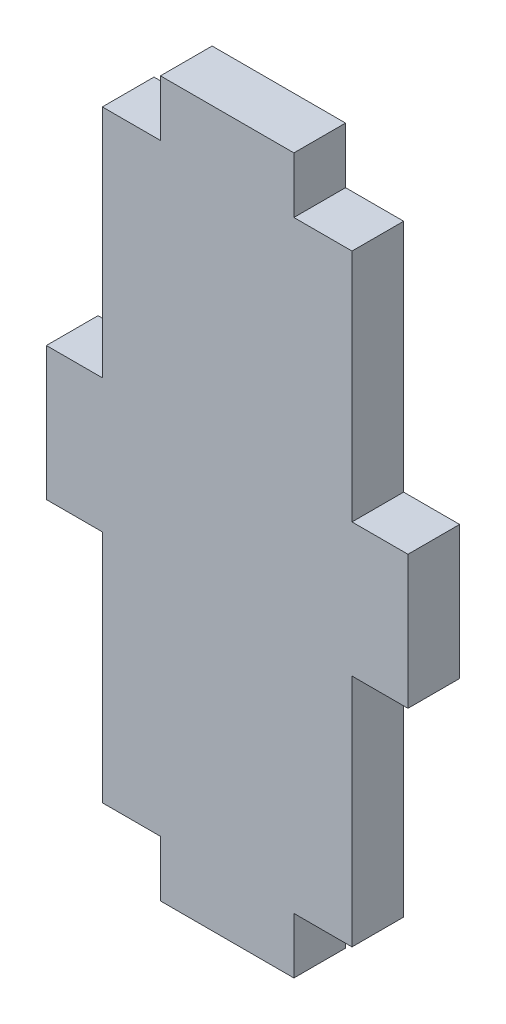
ISO-10303-21;
HEADER;
FILE_DESCRIPTION(('STEP AP214'),'2;1');
FILE_NAME('part.step','',(''),(''),'','','');
FILE_SCHEMA(('AUTOMOTIVE_DESIGN { 1 0 10303 214 1 1 1 1 }'));
ENDSEC;
DATA;
#1=APPLICATION_CONTEXT('core data for automotive mechanical design processes');
#2=APPLICATION_PROTOCOL_DEFINITION('international standard','automotive_design',2000,#1);
#3=PRODUCT_CONTEXT('',#1,'mechanical');
#4=PRODUCT('Part','Part','',(#3));
#5=PRODUCT_RELATED_PRODUCT_CATEGORY('part','',(#4));
#6=PRODUCT_DEFINITION_FORMATION('','',#4);
#7=PRODUCT_DEFINITION_CONTEXT('part definition',#1,'design');
#8=PRODUCT_DEFINITION('design','',#6,#7);
#9=PRODUCT_DEFINITION_SHAPE('','',#8);
#10=(LENGTH_UNIT() NAMED_UNIT(*) SI_UNIT(.MILLI.,.METRE.));
#11=(NAMED_UNIT(*) PLANE_ANGLE_UNIT() SI_UNIT($,.RADIAN.));
#12=(NAMED_UNIT(*) SI_UNIT($,.STERADIAN.) SOLID_ANGLE_UNIT());
#13=UNCERTAINTY_MEASURE_WITH_UNIT(LENGTH_MEASURE(1.E-05),#10,'distance_accuracy_value','');
#14=(GEOMETRIC_REPRESENTATION_CONTEXT(3) GLOBAL_UNCERTAINTY_ASSIGNED_CONTEXT((#13)) GLOBAL_UNIT_ASSIGNED_CONTEXT((#10,
#11,#12)) REPRESENTATION_CONTEXT('',''));
#15=CARTESIAN_POINT('',(0.,0.,0.));
#16=DIRECTION('',(0.,0.,1.));
#17=DIRECTION('',(1.,0.,0.));
#18=AXIS2_PLACEMENT_3D('',#15,#16,#17);
#19=CARTESIAN_POINT('',(7.75,34.9999999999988,6.));
#20=DIRECTION('',(1.80925233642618E-13,-1.,0.));
#21=DIRECTION('',(1.,1.80925233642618E-13,0.));
#22=AXIS2_PLACEMENT_3D('',#19,#20,#21);
#23=PLANE('',#22);
#24=DIRECTION('',(-1.,-1.80925233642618E-13,0.));
#25=VECTOR('',#24,1.);
#26=CARTESIAN_POINT('',(7.75,34.9999999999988,0.));
#27=LINE('',#26,#25);
#28=CARTESIAN_POINT('',(14.5,35.,0.));
#29=VERTEX_POINT('',#28);
#30=CARTESIAN_POINT('',(7.75,34.9999999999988,0.));
#31=VERTEX_POINT('',#30);
#32=EDGE_CURVE('E205',#29,#31,#27,.T.);
#33=ORIENTED_EDGE('',*,*,#32,.T.);
#34=DIRECTION('',(0.,0.,-1.));
#35=VECTOR('',#34,1.);
#36=CARTESIAN_POINT('',(7.75,34.9999999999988,6.));
#37=LINE('',#36,#35);
#38=CARTESIAN_POINT('',(7.75,34.9999999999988,6.));
#39=VERTEX_POINT('',#38);
#40=EDGE_CURVE('E11',#39,#31,#37,.T.);
#41=ORIENTED_EDGE('',*,*,#40,.F.);
#42=DIRECTION('',(-1.,-1.80925233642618E-13,0.));
#43=VECTOR('',#42,1.);
#44=CARTESIAN_POINT('',(7.75,34.9999999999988,6.));
#45=LINE('',#44,#43);
#46=CARTESIAN_POINT('',(14.5,35.,6.));
#47=VERTEX_POINT('',#46);
#48=EDGE_CURVE('E243',#47,#39,#45,.T.);
#49=ORIENTED_EDGE('',*,*,#48,.F.);
#50=DIRECTION('',(0.,0.,-1.));
#51=VECTOR('',#50,1.);
#52=CARTESIAN_POINT('',(14.5,35.,6.));
#53=LINE('',#52,#51);
#54=EDGE_CURVE('E201',#47,#29,#53,.T.);
#55=ORIENTED_EDGE('',*,*,#54,.T.);
#56=EDGE_LOOP('',(#33,#41,#49,#55));
#57=FACE_BOUND('',#56,.T.);
#58=ADVANCED_FACE('F37',(#57),#23,.F.);
#59=CARTESIAN_POINT('',(7.75,34.9999999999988,6.));
#60=DIRECTION('',(-1.,0.,0.));
#61=DIRECTION('',(0.,-1.,0.));
#62=AXIS2_PLACEMENT_3D('',#59,#60,#61);
#63=PLANE('',#62);
#64=DIRECTION('',(0.,1.,0.));
#65=VECTOR('',#64,1.);
#66=CARTESIAN_POINT('',(7.75,34.9999999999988,0.));
#67=LINE('',#66,#65);
#68=CARTESIAN_POINT('',(7.75,41.5,0.));
#69=VERTEX_POINT('',#68);
#70=EDGE_CURVE('E208',#31,#69,#67,.T.);
#71=ORIENTED_EDGE('',*,*,#70,.T.);
#72=DIRECTION('',(0.,0.,-1.));
#73=VECTOR('',#72,1.);
#74=CARTESIAN_POINT('',(7.75,41.5,6.));
#75=LINE('',#74,#73);
#76=CARTESIAN_POINT('',(7.75,41.5,6.));
#77=VERTEX_POINT('',#76);
#78=EDGE_CURVE('E45',#77,#69,#75,.T.);
#79=ORIENTED_EDGE('',*,*,#78,.F.);
#80=DIRECTION('',(0.,1.,0.));
#81=VECTOR('',#80,1.);
#82=CARTESIAN_POINT('',(7.75,34.9999999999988,6.));
#83=LINE('',#82,#81);
#84=EDGE_CURVE('E132',#39,#77,#83,.T.);
#85=ORIENTED_EDGE('',*,*,#84,.F.);
#86=ORIENTED_EDGE('',*,*,#40,.T.);
#87=EDGE_LOOP('',(#71,#79,#85,#86));
#88=FACE_BOUND('',#87,.T.);
#89=ADVANCED_FACE('F361',(#88),#63,.F.);
#90=CARTESIAN_POINT('',(-7.75,41.5,6.));
#91=DIRECTION('',(0.,-1.,0.));
#92=DIRECTION('',(0.,0.,-1.));
#93=AXIS2_PLACEMENT_3D('',#90,#91,#92);
#94=PLANE('',#93);
#95=DIRECTION('',(-1.,0.,0.));
#96=VECTOR('',#95,1.);
#97=CARTESIAN_POINT('',(-7.75,41.5,0.));
#98=LINE('',#97,#96);
#99=CARTESIAN_POINT('',(-7.75,41.5,0.));
#100=VERTEX_POINT('',#99);
#101=EDGE_CURVE('E210',#69,#100,#98,.T.);
#102=ORIENTED_EDGE('',*,*,#101,.T.);
#103=DIRECTION('',(0.,0.,-1.));
#104=VECTOR('',#103,1.);
#105=CARTESIAN_POINT('',(-7.75,41.5,6.));
#106=LINE('',#105,#104);
#107=CARTESIAN_POINT('',(-7.75,41.5,6.));
#108=VERTEX_POINT('',#107);
#109=EDGE_CURVE('E286',#108,#100,#106,.T.);
#110=ORIENTED_EDGE('',*,*,#109,.F.);
#111=DIRECTION('',(-1.,0.,0.));
#112=VECTOR('',#111,1.);
#113=CARTESIAN_POINT('',(-7.75,41.5,6.));
#114=LINE('',#113,#112);
#115=EDGE_CURVE('E294',#77,#108,#114,.T.);
#116=ORIENTED_EDGE('',*,*,#115,.F.);
#117=ORIENTED_EDGE('',*,*,#78,.T.);
#118=EDGE_LOOP('',(#102,#110,#116,#117));
#119=FACE_BOUND('',#118,.T.);
#120=ADVANCED_FACE('F292',(#119),#94,.F.);
#121=CARTESIAN_POINT('',(-7.75,35.,6.));
#122=DIRECTION('',(1.,0.,0.));
#123=DIRECTION('',(0.,0.,-1.));
#124=AXIS2_PLACEMENT_3D('',#121,#122,#123);
#125=PLANE('',#124);
#126=DIRECTION('',(0.,-1.,0.));
#127=VECTOR('',#126,1.);
#128=CARTESIAN_POINT('',(-7.75,35.,0.));
#129=LINE('',#128,#127);
#130=CARTESIAN_POINT('',(-7.75,35.,0.));
#131=VERTEX_POINT('',#130);
#132=EDGE_CURVE('E212',#100,#131,#129,.T.);
#133=ORIENTED_EDGE('',*,*,#132,.T.);
#134=DIRECTION('',(0.,0.,-1.));
#135=VECTOR('',#134,1.);
#136=CARTESIAN_POINT('',(-7.75,35.,6.));
#137=LINE('',#136,#135);
#138=CARTESIAN_POINT('',(-7.75,35.,6.));
#139=VERTEX_POINT('',#138);
#140=EDGE_CURVE('E283',#139,#131,#137,.T.);
#141=ORIENTED_EDGE('',*,*,#140,.F.);
#142=DIRECTION('',(0.,-1.,0.));
#143=VECTOR('',#142,1.);
#144=CARTESIAN_POINT('',(-7.75,35.,6.));
#145=LINE('',#144,#143);
#146=EDGE_CURVE('E312',#108,#139,#145,.T.);
#147=ORIENTED_EDGE('',*,*,#146,.F.);
#148=ORIENTED_EDGE('',*,*,#109,.T.);
#149=EDGE_LOOP('',(#133,#141,#147,#148));
#150=FACE_BOUND('',#149,.T.);
#151=ADVANCED_FACE('F303',(#150),#125,.F.);
#152=CARTESIAN_POINT('',(-14.5,35.,6.));
#153=DIRECTION('',(0.,-1.,0.));
#154=DIRECTION('',(1.,0.,0.));
#155=AXIS2_PLACEMENT_3D('',#152,#153,#154);
#156=PLANE('',#155);
#157=DIRECTION('',(-1.,0.,0.));
#158=VECTOR('',#157,1.);
#159=CARTESIAN_POINT('',(-14.5,35.,0.));
#160=LINE('',#159,#158);
#161=CARTESIAN_POINT('',(-14.5,35.,0.));
#162=VERTEX_POINT('',#161);
#163=EDGE_CURVE('E214',#131,#162,#160,.T.);
#164=ORIENTED_EDGE('',*,*,#163,.T.);
#165=DIRECTION('',(0.,0.,-1.));
#166=VECTOR('',#165,1.);
#167=CARTESIAN_POINT('',(-14.5,35.,6.));
#168=LINE('',#167,#166);
#169=CARTESIAN_POINT('',(-14.5,35.,6.));
#170=VERTEX_POINT('',#169);
#171=EDGE_CURVE('E280',#170,#162,#168,.T.);
#172=ORIENTED_EDGE('',*,*,#171,.F.);
#173=DIRECTION('',(-1.,0.,0.));
#174=VECTOR('',#173,1.);
#175=CARTESIAN_POINT('',(-14.5,35.,6.));
#176=LINE('',#175,#174);
#177=EDGE_CURVE('E309',#139,#170,#176,.T.);
#178=ORIENTED_EDGE('',*,*,#177,.F.);
#179=ORIENTED_EDGE('',*,*,#140,.T.);
#180=EDGE_LOOP('',(#164,#172,#178,#179));
#181=FACE_BOUND('',#180,.T.);
#182=ADVANCED_FACE('F307',(#181),#156,.F.);
#183=CARTESIAN_POINT('',(-14.5,7.75,6.));
#184=DIRECTION('',(1.,0.,0.));
#185=DIRECTION('',(0.,1.,0.));
#186=AXIS2_PLACEMENT_3D('',#183,#184,#185);
#187=PLANE('',#186);
#188=DIRECTION('',(0.,-1.,0.));
#189=VECTOR('',#188,1.);
#190=CARTESIAN_POINT('',(-14.5,7.75,0.));
#191=LINE('',#190,#189);
#192=CARTESIAN_POINT('',(-14.5,7.75,0.));
#193=VERTEX_POINT('',#192);
#194=EDGE_CURVE('E216',#162,#193,#191,.T.);
#195=ORIENTED_EDGE('',*,*,#194,.T.);
#196=DIRECTION('',(0.,0.,-1.));
#197=VECTOR('',#196,1.);
#198=CARTESIAN_POINT('',(-14.5,7.75,6.));
#199=LINE('',#198,#197);
#200=CARTESIAN_POINT('',(-14.5,7.75,6.));
#201=VERTEX_POINT('',#200);
#202=EDGE_CURVE('E277',#201,#193,#199,.T.);
#203=ORIENTED_EDGE('',*,*,#202,.F.);
#204=DIRECTION('',(0.,-1.,0.));
#205=VECTOR('',#204,1.);
#206=CARTESIAN_POINT('',(-14.5,7.75,6.));
#207=LINE('',#206,#205);
#208=EDGE_CURVE('E311',#170,#201,#207,.T.);
#209=ORIENTED_EDGE('',*,*,#208,.F.);
#210=ORIENTED_EDGE('',*,*,#171,.T.);
#211=EDGE_LOOP('',(#195,#203,#209,#210));
#212=FACE_BOUND('',#211,.T.);
#213=ADVANCED_FACE('F374',(#212),#187,.F.);
#214=CARTESIAN_POINT('',(-21.,7.75,6.));
#215=DIRECTION('',(0.,-1.,0.));
#216=DIRECTION('',(0.,0.,-1.));
#217=AXIS2_PLACEMENT_3D('',#214,#215,#216);
#218=PLANE('',#217);
#219=DIRECTION('',(-1.,0.,0.));
#220=VECTOR('',#219,1.);
#221=CARTESIAN_POINT('',(-21.,7.75,0.));
#222=LINE('',#221,#220);
#223=CARTESIAN_POINT('',(-21.,7.75,0.));
#224=VERTEX_POINT('',#223);
#225=EDGE_CURVE('E218',#193,#224,#222,.T.);
#226=ORIENTED_EDGE('',*,*,#225,.T.);
#227=DIRECTION('',(0.,0.,-1.));
#228=VECTOR('',#227,1.);
#229=CARTESIAN_POINT('',(-21.,7.75,6.));
#230=LINE('',#229,#228);
#231=CARTESIAN_POINT('',(-21.,7.75,6.));
#232=VERTEX_POINT('',#231);
#233=EDGE_CURVE('E274',#232,#224,#230,.T.);
#234=ORIENTED_EDGE('',*,*,#233,.F.);
#235=DIRECTION('',(-1.,0.,0.));
#236=VECTOR('',#235,1.);
#237=CARTESIAN_POINT('',(-21.,7.75,6.));
#238=LINE('',#237,#236);
#239=EDGE_CURVE('E314',#201,#232,#238,.T.);
#240=ORIENTED_EDGE('',*,*,#239,.F.);
#241=ORIENTED_EDGE('',*,*,#202,.T.);
#242=EDGE_LOOP('',(#226,#234,#240,#241));
#243=FACE_BOUND('',#242,.T.);
#244=ADVANCED_FACE('F377',(#243),#218,.F.);
#245=CARTESIAN_POINT('',(-21.,-7.75,6.));
#246=DIRECTION('',(1.,0.,0.));
#247=DIRECTION('',(0.,1.,0.));
#248=AXIS2_PLACEMENT_3D('',#245,#246,#247);
#249=PLANE('',#248);
#250=DIRECTION('',(0.,-1.,0.));
#251=VECTOR('',#250,1.);
#252=CARTESIAN_POINT('',(-21.,-7.75,0.));
#253=LINE('',#252,#251);
#254=CARTESIAN_POINT('',(-21.,-7.75,0.));
#255=VERTEX_POINT('',#254);
#256=EDGE_CURVE('E220',#224,#255,#253,.T.);
#257=ORIENTED_EDGE('',*,*,#256,.T.);
#258=DIRECTION('',(0.,0.,-1.));
#259=VECTOR('',#258,1.);
#260=CARTESIAN_POINT('',(-21.,-7.75,6.));
#261=LINE('',#260,#259);
#262=CARTESIAN_POINT('',(-21.,-7.75,6.));
#263=VERTEX_POINT('',#262);
#264=EDGE_CURVE('E271',#263,#255,#261,.T.);
#265=ORIENTED_EDGE('',*,*,#264,.F.);
#266=DIRECTION('',(0.,-1.,0.));
#267=VECTOR('',#266,1.);
#268=CARTESIAN_POINT('',(-21.,-7.75,6.));
#269=LINE('',#268,#267);
#270=EDGE_CURVE('E320',#232,#263,#269,.T.);
#271=ORIENTED_EDGE('',*,*,#270,.F.);
#272=ORIENTED_EDGE('',*,*,#233,.T.);
#273=EDGE_LOOP('',(#257,#265,#271,#272));
#274=FACE_BOUND('',#273,.T.);
#275=ADVANCED_FACE('F381',(#274),#249,.F.);
#276=CARTESIAN_POINT('',(-21.,-7.75,6.));
#277=DIRECTION('',(0.,1.,0.));
#278=DIRECTION('',(-1.,0.,0.));
#279=AXIS2_PLACEMENT_3D('',#276,#277,#278);
#280=PLANE('',#279);
#281=DIRECTION('',(1.,0.,0.));
#282=VECTOR('',#281,1.);
#283=CARTESIAN_POINT('',(-21.,-7.75,0.));
#284=LINE('',#283,#282);
#285=CARTESIAN_POINT('',(-14.5,-7.75,0.));
#286=VERTEX_POINT('',#285);
#287=EDGE_CURVE('E222',#255,#286,#284,.T.);
#288=ORIENTED_EDGE('',*,*,#287,.T.);
#289=DIRECTION('',(0.,0.,-1.));
#290=VECTOR('',#289,1.);
#291=CARTESIAN_POINT('',(-14.5,-7.75,6.));
#292=LINE('',#291,#290);
#293=CARTESIAN_POINT('',(-14.5,-7.75,6.));
#294=VERTEX_POINT('',#293);
#295=EDGE_CURVE('E268',#294,#286,#292,.T.);
#296=ORIENTED_EDGE('',*,*,#295,.F.);
#297=DIRECTION('',(1.,0.,0.));
#298=VECTOR('',#297,1.);
#299=CARTESIAN_POINT('',(-21.,-7.75,6.));
#300=LINE('',#299,#298);
#301=EDGE_CURVE('E322',#263,#294,#300,.T.);
#302=ORIENTED_EDGE('',*,*,#301,.F.);
#303=ORIENTED_EDGE('',*,*,#264,.T.);
#304=EDGE_LOOP('',(#288,#296,#302,#303));
#305=FACE_BOUND('',#304,.T.);
#306=ADVANCED_FACE('F385',(#305),#280,.F.);
#307=CARTESIAN_POINT('',(-14.5,-35.,6.));
#308=DIRECTION('',(1.,0.,0.));
#309=DIRECTION('',(0.,1.,0.));
#310=AXIS2_PLACEMENT_3D('',#307,#308,#309);
#311=PLANE('',#310);
#312=DIRECTION('',(0.,-1.,0.));
#313=VECTOR('',#312,1.);
#314=CARTESIAN_POINT('',(-14.5,-35.,0.));
#315=LINE('',#314,#313);
#316=CARTESIAN_POINT('',(-14.5,-35.,0.));
#317=VERTEX_POINT('',#316);
#318=EDGE_CURVE('E224',#286,#317,#315,.T.);
#319=ORIENTED_EDGE('',*,*,#318,.T.);
#320=DIRECTION('',(0.,0.,-1.));
#321=VECTOR('',#320,1.);
#322=CARTESIAN_POINT('',(-14.5,-35.,6.));
#323=LINE('',#322,#321);
#324=CARTESIAN_POINT('',(-14.5,-35.,6.));
#325=VERTEX_POINT('',#324);
#326=EDGE_CURVE('E265',#325,#317,#323,.T.);
#327=ORIENTED_EDGE('',*,*,#326,.F.);
#328=DIRECTION('',(0.,-1.,0.));
#329=VECTOR('',#328,1.);
#330=CARTESIAN_POINT('',(-14.5,-35.,6.));
#331=LINE('',#330,#329);
#332=EDGE_CURVE('E324',#294,#325,#331,.T.);
#333=ORIENTED_EDGE('',*,*,#332,.F.);
#334=ORIENTED_EDGE('',*,*,#295,.T.);
#335=EDGE_LOOP('',(#319,#327,#333,#334));
#336=FACE_BOUND('',#335,.T.);
#337=ADVANCED_FACE('F389',(#336),#311,.F.);
#338=CARTESIAN_POINT('',(-14.5,-35.,6.));
#339=DIRECTION('',(0.,1.,0.));
#340=DIRECTION('',(-1.,0.,0.));
#341=AXIS2_PLACEMENT_3D('',#338,#339,#340);
#342=PLANE('',#341);
#343=DIRECTION('',(1.,0.,0.));
#344=VECTOR('',#343,1.);
#345=CARTESIAN_POINT('',(-14.5,-35.,0.));
#346=LINE('',#345,#344);
#347=CARTESIAN_POINT('',(-7.75,-35.,0.));
#348=VERTEX_POINT('',#347);
#349=EDGE_CURVE('E226',#317,#348,#346,.T.);
#350=ORIENTED_EDGE('',*,*,#349,.T.);
#351=DIRECTION('',(0.,0.,-1.));
#352=VECTOR('',#351,1.);
#353=CARTESIAN_POINT('',(-7.75,-35.,6.));
#354=LINE('',#353,#352);
#355=CARTESIAN_POINT('',(-7.75,-35.,6.));
#356=VERTEX_POINT('',#355);
#357=EDGE_CURVE('E262',#356,#348,#354,.T.);
#358=ORIENTED_EDGE('',*,*,#357,.F.);
#359=DIRECTION('',(1.,0.,0.));
#360=VECTOR('',#359,1.);
#361=CARTESIAN_POINT('',(-14.5,-35.,6.));
#362=LINE('',#361,#360);
#363=EDGE_CURVE('E326',#325,#356,#362,.T.);
#364=ORIENTED_EDGE('',*,*,#363,.F.);
#365=ORIENTED_EDGE('',*,*,#326,.T.);
#366=EDGE_LOOP('',(#350,#358,#364,#365));
#367=FACE_BOUND('',#366,.T.);
#368=ADVANCED_FACE('F393',(#367),#342,.F.);
#369=CARTESIAN_POINT('',(-7.75,-35.,6.));
#370=DIRECTION('',(1.,0.,0.));
#371=DIRECTION('',(0.,1.,0.));
#372=AXIS2_PLACEMENT_3D('',#369,#370,#371);
#373=PLANE('',#372);
#374=DIRECTION('',(0.,-1.,0.));
#375=VECTOR('',#374,1.);
#376=CARTESIAN_POINT('',(-7.75,-35.,0.));
#377=LINE('',#376,#375);
#378=CARTESIAN_POINT('',(-7.75,-41.5,0.));
#379=VERTEX_POINT('',#378);
#380=EDGE_CURVE('E228',#348,#379,#377,.T.);
#381=ORIENTED_EDGE('',*,*,#380,.T.);
#382=DIRECTION('',(0.,0.,-1.));
#383=VECTOR('',#382,1.);
#384=CARTESIAN_POINT('',(-7.75,-41.5,6.));
#385=LINE('',#384,#383);
#386=CARTESIAN_POINT('',(-7.75,-41.5,6.));
#387=VERTEX_POINT('',#386);
#388=EDGE_CURVE('E259',#387,#379,#385,.T.);
#389=ORIENTED_EDGE('',*,*,#388,.F.);
#390=DIRECTION('',(0.,-1.,0.));
#391=VECTOR('',#390,1.);
#392=CARTESIAN_POINT('',(-7.75,-35.,6.));
#393=LINE('',#392,#391);
#394=EDGE_CURVE('E328',#356,#387,#393,.T.);
#395=ORIENTED_EDGE('',*,*,#394,.F.);
#396=ORIENTED_EDGE('',*,*,#357,.T.);
#397=EDGE_LOOP('',(#381,#389,#395,#396));
#398=FACE_BOUND('',#397,.T.);
#399=ADVANCED_FACE('F397',(#398),#373,.F.);
#400=CARTESIAN_POINT('',(-7.75,-41.5,6.));
#401=DIRECTION('',(0.,1.,0.));
#402=DIRECTION('',(0.,0.,1.));
#403=AXIS2_PLACEMENT_3D('',#400,#401,#402);
#404=PLANE('',#403);
#405=DIRECTION('',(1.,0.,0.));
#406=VECTOR('',#405,1.);
#407=CARTESIAN_POINT('',(-7.75,-41.5,0.));
#408=LINE('',#407,#406);
#409=CARTESIAN_POINT('',(7.75,-41.5,0.));
#410=VERTEX_POINT('',#409);
#411=EDGE_CURVE('E230',#379,#410,#408,.T.);
#412=ORIENTED_EDGE('',*,*,#411,.T.);
#413=DIRECTION('',(0.,0.,-1.));
#414=VECTOR('',#413,1.);
#415=CARTESIAN_POINT('',(7.75,-41.5,6.));
#416=LINE('',#415,#414);
#417=CARTESIAN_POINT('',(7.75,-41.5,6.));
#418=VERTEX_POINT('',#417);
#419=EDGE_CURVE('E256',#418,#410,#416,.T.);
#420=ORIENTED_EDGE('',*,*,#419,.F.);
#421=DIRECTION('',(1.,0.,0.));
#422=VECTOR('',#421,1.);
#423=CARTESIAN_POINT('',(-7.75,-41.5,6.));
#424=LINE('',#423,#422);
#425=EDGE_CURVE('E330',#387,#418,#424,.T.);
#426=ORIENTED_EDGE('',*,*,#425,.F.);
#427=ORIENTED_EDGE('',*,*,#388,.T.);
#428=EDGE_LOOP('',(#412,#420,#426,#427));
#429=FACE_BOUND('',#428,.T.);
#430=ADVANCED_FACE('F401',(#429),#404,.F.);
#431=CARTESIAN_POINT('',(7.75,-35.,6.));
#432=DIRECTION('',(-1.,0.,0.));
#433=DIRECTION('',(0.,-1.,0.));
#434=AXIS2_PLACEMENT_3D('',#431,#432,#433);
#435=PLANE('',#434);
#436=DIRECTION('',(0.,1.,0.));
#437=VECTOR('',#436,1.);
#438=CARTESIAN_POINT('',(7.75,-35.,0.));
#439=LINE('',#438,#437);
#440=CARTESIAN_POINT('',(7.75,-35.,0.));
#441=VERTEX_POINT('',#440);
#442=EDGE_CURVE('E232',#410,#441,#439,.T.);
#443=ORIENTED_EDGE('',*,*,#442,.T.);
#444=DIRECTION('',(0.,0.,-1.));
#445=VECTOR('',#444,1.);
#446=CARTESIAN_POINT('',(7.75,-35.,6.));
#447=LINE('',#446,#445);
#448=CARTESIAN_POINT('',(7.75,-35.,6.));
#449=VERTEX_POINT('',#448);
#450=EDGE_CURVE('E253',#449,#441,#447,.T.);
#451=ORIENTED_EDGE('',*,*,#450,.F.);
#452=DIRECTION('',(0.,1.,0.));
#453=VECTOR('',#452,1.);
#454=CARTESIAN_POINT('',(7.75,-35.,6.));
#455=LINE('',#454,#453);
#456=EDGE_CURVE('E332',#418,#449,#455,.T.);
#457=ORIENTED_EDGE('',*,*,#456,.F.);
#458=ORIENTED_EDGE('',*,*,#419,.T.);
#459=EDGE_LOOP('',(#443,#451,#457,#458));
#460=FACE_BOUND('',#459,.T.);
#461=ADVANCED_FACE('F405',(#460),#435,.F.);
#462=CARTESIAN_POINT('',(7.75,-35.,6.));
#463=DIRECTION('',(0.,1.,0.));
#464=DIRECTION('',(-1.,0.,0.));
#465=AXIS2_PLACEMENT_3D('',#462,#463,#464);
#466=PLANE('',#465);
#467=DIRECTION('',(1.,0.,0.));
#468=VECTOR('',#467,1.);
#469=CARTESIAN_POINT('',(7.75,-35.,0.));
#470=LINE('',#469,#468);
#471=CARTESIAN_POINT('',(14.5,-35.,0.));
#472=VERTEX_POINT('',#471);
#473=EDGE_CURVE('E234',#441,#472,#470,.T.);
#474=ORIENTED_EDGE('',*,*,#473,.T.);
#475=DIRECTION('',(0.,0.,-1.));
#476=VECTOR('',#475,1.);
#477=CARTESIAN_POINT('',(14.5,-35.,6.));
#478=LINE('',#477,#476);
#479=CARTESIAN_POINT('',(14.5,-35.,6.));
#480=VERTEX_POINT('',#479);
#481=EDGE_CURVE('E250',#480,#472,#478,.T.);
#482=ORIENTED_EDGE('',*,*,#481,.F.);
#483=DIRECTION('',(1.,0.,0.));
#484=VECTOR('',#483,1.);
#485=CARTESIAN_POINT('',(7.75,-35.,6.));
#486=LINE('',#485,#484);
#487=EDGE_CURVE('E334',#449,#480,#486,.T.);
#488=ORIENTED_EDGE('',*,*,#487,.F.);
#489=ORIENTED_EDGE('',*,*,#450,.T.);
#490=EDGE_LOOP('',(#474,#482,#488,#489));
#491=FACE_BOUND('',#490,.T.);
#492=ADVANCED_FACE('F409',(#491),#466,.F.);
#493=CARTESIAN_POINT('',(14.5,-35.,6.));
#494=DIRECTION('',(-1.,0.,0.));
#495=DIRECTION('',(0.,-1.,0.));
#496=AXIS2_PLACEMENT_3D('',#493,#494,#495);
#497=PLANE('',#496);
#498=DIRECTION('',(0.,1.,0.));
#499=VECTOR('',#498,1.);
#500=CARTESIAN_POINT('',(14.5,-35.,0.));
#501=LINE('',#500,#499);
#502=CARTESIAN_POINT('',(14.5,-7.74999999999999,0.));
#503=VERTEX_POINT('',#502);
#504=EDGE_CURVE('E236',#472,#503,#501,.T.);
#505=ORIENTED_EDGE('',*,*,#504,.T.);
#506=DIRECTION('',(0.,0.,-1.));
#507=VECTOR('',#506,1.);
#508=CARTESIAN_POINT('',(14.5,-7.74999999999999,6.));
#509=LINE('',#508,#507);
#510=CARTESIAN_POINT('',(14.5,-7.74999999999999,6.));
#511=VERTEX_POINT('',#510);
#512=EDGE_CURVE('E247',#511,#503,#509,.T.);
#513=ORIENTED_EDGE('',*,*,#512,.F.);
#514=DIRECTION('',(0.,1.,0.));
#515=VECTOR('',#514,1.);
#516=CARTESIAN_POINT('',(14.5,-35.,6.));
#517=LINE('',#516,#515);
#518=EDGE_CURVE('E336',#480,#511,#517,.T.);
#519=ORIENTED_EDGE('',*,*,#518,.F.);
#520=ORIENTED_EDGE('',*,*,#481,.T.);
#521=EDGE_LOOP('',(#505,#513,#519,#520));
#522=FACE_BOUND('',#521,.T.);
#523=ADVANCED_FACE('F342',(#522),#497,.F.);
#524=CARTESIAN_POINT('',(21.,-7.74999999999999,6.));
#525=DIRECTION('',(0.,1.,0.));
#526=DIRECTION('',(-1.,0.,0.));
#527=AXIS2_PLACEMENT_3D('',#524,#525,#526);
#528=PLANE('',#527);
#529=DIRECTION('',(1.,0.,0.));
#530=VECTOR('',#529,1.);
#531=CARTESIAN_POINT('',(21.,-7.74999999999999,0.));
#532=LINE('',#531,#530);
#533=CARTESIAN_POINT('',(21.,-7.74999999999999,0.));
#534=VERTEX_POINT('',#533);
#535=EDGE_CURVE('E238',#503,#534,#532,.T.);
#536=ORIENTED_EDGE('',*,*,#535,.T.);
#537=DIRECTION('',(0.,0.,-1.));
#538=VECTOR('',#537,1.);
#539=CARTESIAN_POINT('',(21.,-7.74999999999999,6.));
#540=LINE('',#539,#538);
#541=CARTESIAN_POINT('',(21.,-7.74999999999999,6.));
#542=VERTEX_POINT('',#541);
#543=EDGE_CURVE('E196',#542,#534,#540,.T.);
#544=ORIENTED_EDGE('',*,*,#543,.F.);
#545=DIRECTION('',(1.,0.,0.));
#546=VECTOR('',#545,1.);
#547=CARTESIAN_POINT('',(21.,-7.74999999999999,6.));
#548=LINE('',#547,#546);
#549=EDGE_CURVE('E187',#511,#542,#548,.T.);
#550=ORIENTED_EDGE('',*,*,#549,.F.);
#551=ORIENTED_EDGE('',*,*,#512,.T.);
#552=EDGE_LOOP('',(#536,#544,#550,#551));
#553=FACE_BOUND('',#552,.T.);
#554=ADVANCED_FACE('F346',(#553),#528,.F.);
#555=CARTESIAN_POINT('',(21.,7.75,6.));
#556=DIRECTION('',(-1.,0.,0.));
#557=DIRECTION('',(0.,-1.,0.));
#558=AXIS2_PLACEMENT_3D('',#555,#556,#557);
#559=PLANE('',#558);
#560=DIRECTION('',(0.,1.,0.));
#561=VECTOR('',#560,1.);
#562=CARTESIAN_POINT('',(21.,7.75,0.));
#563=LINE('',#562,#561);
#564=CARTESIAN_POINT('',(21.,7.75,0.));
#565=VERTEX_POINT('',#564);
#566=EDGE_CURVE('E195',#534,#565,#563,.T.);
#567=ORIENTED_EDGE('',*,*,#566,.T.);
#568=DIRECTION('',(0.,0.,-1.));
#569=VECTOR('',#568,1.);
#570=CARTESIAN_POINT('',(21.,7.75,6.));
#571=LINE('',#570,#569);
#572=CARTESIAN_POINT('',(21.,7.75,6.));
#573=VERTEX_POINT('',#572);
#574=EDGE_CURVE('E192',#573,#565,#571,.T.);
#575=ORIENTED_EDGE('',*,*,#574,.F.);
#576=DIRECTION('',(0.,1.,0.));
#577=VECTOR('',#576,1.);
#578=CARTESIAN_POINT('',(21.,7.75,6.));
#579=LINE('',#578,#577);
#580=EDGE_CURVE('E181',#542,#573,#579,.T.);
#581=ORIENTED_EDGE('',*,*,#580,.F.);
#582=ORIENTED_EDGE('',*,*,#543,.T.);
#583=EDGE_LOOP('',(#567,#575,#581,#582));
#584=FACE_BOUND('',#583,.T.);
#585=ADVANCED_FACE('F193',(#584),#559,.F.);
#586=CARTESIAN_POINT('',(14.5,7.75,6.));
#587=DIRECTION('',(0.,-1.,0.));
#588=DIRECTION('',(0.,0.,-1.));
#589=AXIS2_PLACEMENT_3D('',#586,#587,#588);
#590=PLANE('',#589);
#591=DIRECTION('',(-1.,0.,0.));
#592=VECTOR('',#591,1.);
#593=CARTESIAN_POINT('',(14.5,7.75,0.));
#594=LINE('',#593,#592);
#595=CARTESIAN_POINT('',(14.5,7.75,0.));
#596=VERTEX_POINT('',#595);
#597=EDGE_CURVE('E118',#565,#596,#594,.T.);
#598=ORIENTED_EDGE('',*,*,#597,.T.);
#599=DIRECTION('',(0.,0.,-1.));
#600=VECTOR('',#599,1.);
#601=CARTESIAN_POINT('',(14.5,7.75,6.));
#602=LINE('',#601,#600);
#603=CARTESIAN_POINT('',(14.5,7.75,6.));
#604=VERTEX_POINT('',#603);
#605=EDGE_CURVE('E197',#604,#596,#602,.T.);
#606=ORIENTED_EDGE('',*,*,#605,.F.);
#607=DIRECTION('',(-1.,0.,0.));
#608=VECTOR('',#607,1.);
#609=CARTESIAN_POINT('',(14.5,7.75,6.));
#610=LINE('',#609,#608);
#611=EDGE_CURVE('E185',#573,#604,#610,.T.);
#612=ORIENTED_EDGE('',*,*,#611,.F.);
#613=ORIENTED_EDGE('',*,*,#574,.T.);
#614=EDGE_LOOP('',(#598,#606,#612,#613));
#615=FACE_BOUND('',#614,.T.);
#616=ADVANCED_FACE('F199',(#615),#590,.F.);
#617=CARTESIAN_POINT('',(14.5,7.75,6.));
#618=DIRECTION('',(-1.,0.,0.));
#619=DIRECTION('',(0.,-1.,0.));
#620=AXIS2_PLACEMENT_3D('',#617,#618,#619);
#621=PLANE('',#620);
#622=DIRECTION('',(0.,1.,0.));
#623=VECTOR('',#622,1.);
#624=CARTESIAN_POINT('',(14.5,7.75,0.));
#625=LINE('',#624,#623);
#626=EDGE_CURVE('E124',#596,#29,#625,.T.);
#627=ORIENTED_EDGE('',*,*,#626,.T.);
#628=ORIENTED_EDGE('',*,*,#54,.F.);
#629=DIRECTION('',(0.,1.,0.));
#630=VECTOR('',#629,1.);
#631=CARTESIAN_POINT('',(14.5,7.75,6.));
#632=LINE('',#631,#630);
#633=EDGE_CURVE('E53',#604,#47,#632,.T.);
#634=ORIENTED_EDGE('',*,*,#633,.F.);
#635=ORIENTED_EDGE('',*,*,#605,.T.);
#636=EDGE_LOOP('',(#627,#628,#634,#635));
#637=FACE_BOUND('',#636,.T.);
#638=ADVANCED_FACE('F350',(#637),#621,.F.);
#639=CARTESIAN_POINT('',(0.,0.,6.));
#640=DIRECTION('',(0.,0.,1.));
#641=DIRECTION('',(1.,0.,0.));
#642=AXIS2_PLACEMENT_3D('',#639,#640,#641);
#643=PLANE('',#642);
#644=ORIENTED_EDGE('',*,*,#48,.T.);
#645=ORIENTED_EDGE('',*,*,#84,.T.);
#646=ORIENTED_EDGE('',*,*,#115,.T.);
#647=ORIENTED_EDGE('',*,*,#146,.T.);
#648=ORIENTED_EDGE('',*,*,#177,.T.);
#649=ORIENTED_EDGE('',*,*,#208,.T.);
#650=ORIENTED_EDGE('',*,*,#239,.T.);
#651=ORIENTED_EDGE('',*,*,#270,.T.);
#652=ORIENTED_EDGE('',*,*,#301,.T.);
#653=ORIENTED_EDGE('',*,*,#332,.T.);
#654=ORIENTED_EDGE('',*,*,#363,.T.);
#655=ORIENTED_EDGE('',*,*,#394,.T.);
#656=ORIENTED_EDGE('',*,*,#425,.T.);
#657=ORIENTED_EDGE('',*,*,#456,.T.);
#658=ORIENTED_EDGE('',*,*,#487,.T.);
#659=ORIENTED_EDGE('',*,*,#518,.T.);
#660=ORIENTED_EDGE('',*,*,#549,.T.);
#661=ORIENTED_EDGE('',*,*,#580,.T.);
#662=ORIENTED_EDGE('',*,*,#611,.T.);
#663=ORIENTED_EDGE('',*,*,#633,.T.);
#664=EDGE_LOOP('',(#644,#645,#646,#647,#648,#649,#650,#651,#652,#653,#654,#655,#656,#657,#658,
#659,#660,#661,#662,#663));
#665=FACE_BOUND('',#664,.T.);
#666=ADVANCED_FACE('F183',(#665),#643,.T.);
#667=CARTESIAN_POINT('',(0.,0.,0.));
#668=DIRECTION('',(0.,0.,1.));
#669=DIRECTION('',(1.,0.,0.));
#670=AXIS2_PLACEMENT_3D('',#667,#668,#669);
#671=PLANE('',#670);
#672=ORIENTED_EDGE('',*,*,#32,.F.);
#673=ORIENTED_EDGE('',*,*,#626,.F.);
#674=ORIENTED_EDGE('',*,*,#597,.F.);
#675=ORIENTED_EDGE('',*,*,#566,.F.);
#676=ORIENTED_EDGE('',*,*,#535,.F.);
#677=ORIENTED_EDGE('',*,*,#504,.F.);
#678=ORIENTED_EDGE('',*,*,#473,.F.);
#679=ORIENTED_EDGE('',*,*,#442,.F.);
#680=ORIENTED_EDGE('',*,*,#411,.F.);
#681=ORIENTED_EDGE('',*,*,#380,.F.);
#682=ORIENTED_EDGE('',*,*,#349,.F.);
#683=ORIENTED_EDGE('',*,*,#318,.F.);
#684=ORIENTED_EDGE('',*,*,#287,.F.);
#685=ORIENTED_EDGE('',*,*,#256,.F.);
#686=ORIENTED_EDGE('',*,*,#225,.F.);
#687=ORIENTED_EDGE('',*,*,#194,.F.);
#688=ORIENTED_EDGE('',*,*,#163,.F.);
#689=ORIENTED_EDGE('',*,*,#132,.F.);
#690=ORIENTED_EDGE('',*,*,#101,.F.);
#691=ORIENTED_EDGE('',*,*,#70,.F.);
#692=EDGE_LOOP('',(#672,#673,#674,#675,#676,#677,#678,#679,#680,#681,#682,#683,#684,#685,#686,
#687,#688,#689,#690,#691));
#693=FACE_BOUND('',#692,.T.);
#694=ADVANCED_FACE('F298',(#693),#671,.F.);
#695=CLOSED_SHELL('',(#58,#89,#120,#151,#182,#213,#244,#275,#306,#337,#368,#399,#430,#461,#492,
#523,#554,#585,#616,#638,#666,#694));
#696=MANIFOLD_SOLID_BREP('B2',#695);
#697=ADVANCED_BREP_SHAPE_REPRESENTATION('',(#18,#696),#14);
#698=SHAPE_DEFINITION_REPRESENTATION(#9,#697);
ENDSEC;
END-ISO-10303-21;
